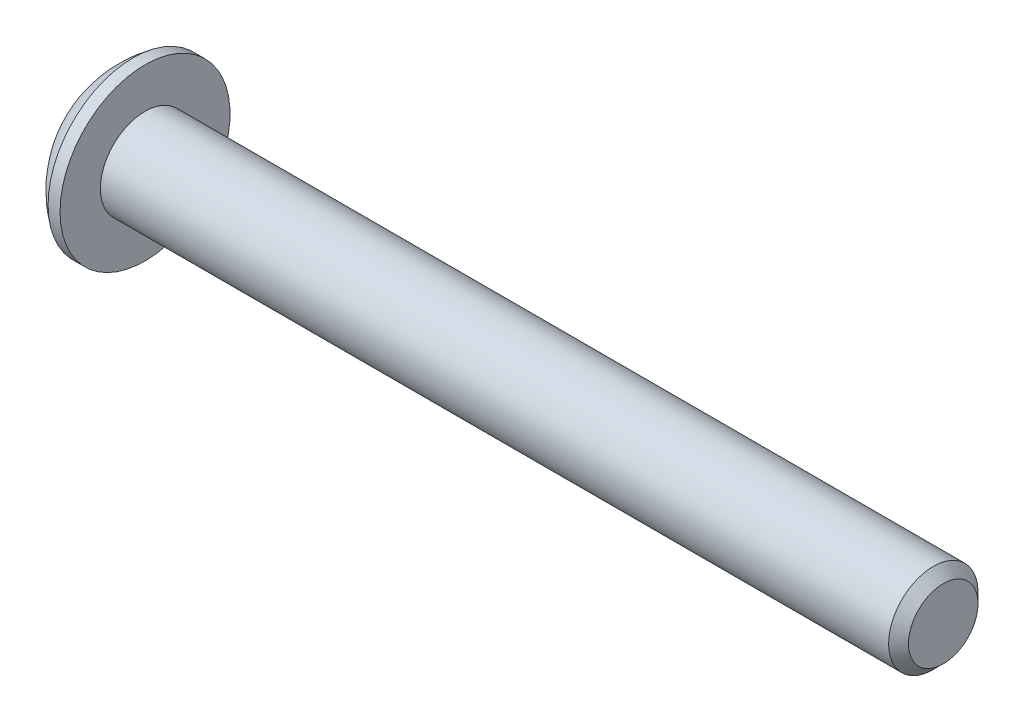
from build123d import *

# Parameters (mm, degrees)
SPLINE_DEPTH      = 0.889
CIRPATTERN1_COUNT = 6


with BuildPart() as part:
    # BodySke → BaseBody (revolve)
    with BuildSketch(Plane.XY, mode=Mode.PRIVATE) as basebody_sk:
        with BuildLine():
            Line((26.8986, 0), (26.8986, 1.10617))
            Line((26.8986, 1.10617), (26.58237, 1.4224))
            Line((26.58237, 1.4224), (1.4986, 1.4224))
            Line((1.4986, 1.4224), (1.4986, 2.7051))
            Line((1.4986, 2.7051), (1.1176, 2.7051))
            ThreePointArc((1.1176, 2.7051), (0.467369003, 2.104373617), (0, 1.35255))
            Line((0, 1.35255), (0, 0))
            Line((0, 0), (26.8986, 0))
        make_face()
    revolve(basebody_sk.sketch.rotate(Axis((0, 0, 0), (1, 0, 0)), 90), axis=Axis((0, 0, 0), (1, 0, 0)))

    # Sketch4 → Spline (cut)
    with BuildSketch(Plane(origin=(0, 9.525, 0), x_dir=(0, 0, -1), z_dir=(1, 0, 0))):
        with BuildLine():
            Line((0, -9.525), (0.9398, -9.525))
            ThreePointArc((0.9398, -9.525), (0.928845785, -9.381928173), (0.896238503, -9.242191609))
            Line((0.896238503, -9.242191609), (0.78315352, -9.307481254))
            ThreePointArc((0.78315352, -9.307481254), (0.703905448, -9.1186), (0.57995352, -8.95552853))
            Line((0.57995352, -8.95552853), (0.693038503, -8.890238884))
            ThreePointArc((0.693038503, -8.890238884), (0.588326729, -8.792131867), (0.4699, -8.711109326))
            Line((0.4699, -8.711109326), (0, -9.525))
        make_face()
    spline = extrude(amount=SPLINE_DEPTH, mode=Mode.SUBTRACT)

    # CirPattern1: Spline ×6 about axis
    cirpattern1_axis = Axis((0, 0, 0), (1, 0, 0))
    for i in range(1, CIRPATTERN1_COUNT):
        add(spline.rotate(cirpattern1_axis, i * 360 / CIRPATTERN1_COUNT), mode=Mode.SUBTRACT)


solid = part.part
